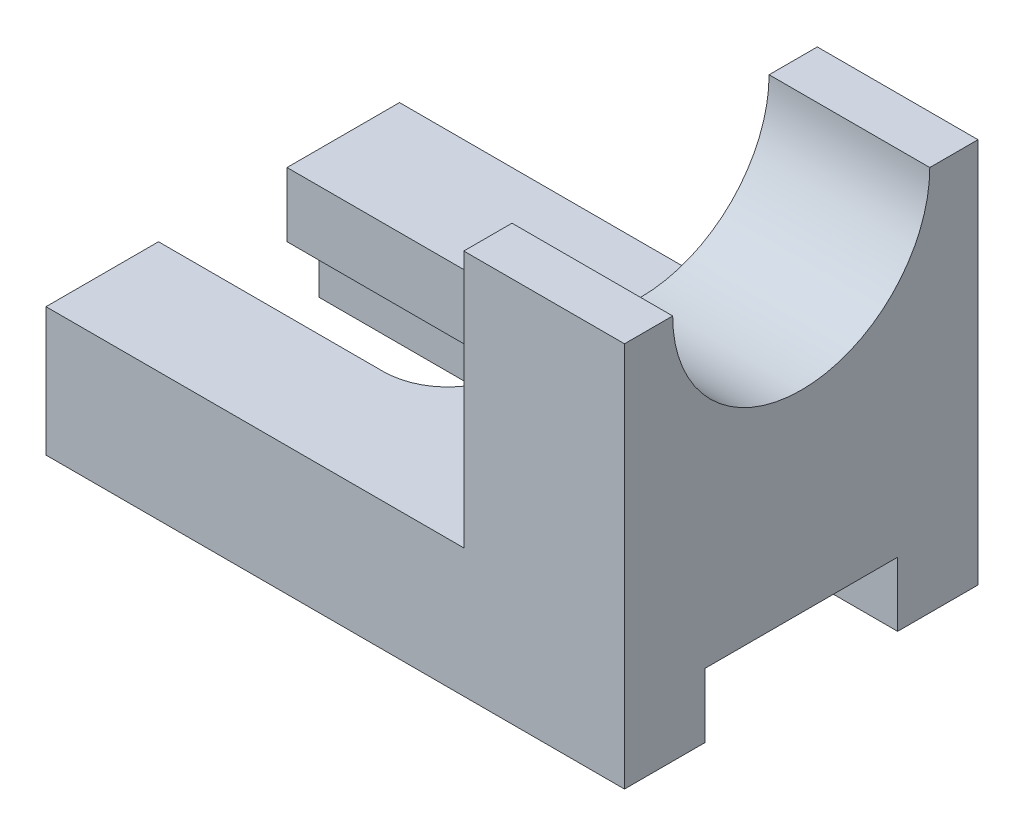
ISO-10303-21;
HEADER;
FILE_DESCRIPTION(('STEP AP214'),'2;1');
FILE_NAME('part.step','',(''),(''),'','','');
FILE_SCHEMA(('AUTOMOTIVE_DESIGN { 1 0 10303 214 1 1 1 1 }'));
ENDSEC;
DATA;
#1=APPLICATION_CONTEXT('core data for automotive mechanical design processes');
#2=APPLICATION_PROTOCOL_DEFINITION('international standard','automotive_design',2000,#1);
#3=PRODUCT_CONTEXT('',#1,'mechanical');
#4=PRODUCT('Part','Part','',(#3));
#5=PRODUCT_RELATED_PRODUCT_CATEGORY('part','',(#4));
#6=PRODUCT_DEFINITION_FORMATION('','',#4);
#7=PRODUCT_DEFINITION_CONTEXT('part definition',#1,'design');
#8=PRODUCT_DEFINITION('design','',#6,#7);
#9=PRODUCT_DEFINITION_SHAPE('','',#8);
#10=(LENGTH_UNIT() NAMED_UNIT(*) SI_UNIT(.MILLI.,.METRE.));
#11=(NAMED_UNIT(*) PLANE_ANGLE_UNIT() SI_UNIT($,.RADIAN.));
#12=(NAMED_UNIT(*) SI_UNIT($,.STERADIAN.) SOLID_ANGLE_UNIT());
#13=UNCERTAINTY_MEASURE_WITH_UNIT(LENGTH_MEASURE(1.E-05),#10,'distance_accuracy_value','');
#14=(GEOMETRIC_REPRESENTATION_CONTEXT(3) GLOBAL_UNCERTAINTY_ASSIGNED_CONTEXT((#13)) GLOBAL_UNIT_ASSIGNED_CONTEXT((#10,
#11,#12)) REPRESENTATION_CONTEXT('',''));
#15=CARTESIAN_POINT('',(0.,0.,0.));
#16=DIRECTION('',(0.,0.,1.));
#17=DIRECTION('',(1.,0.,0.));
#18=AXIS2_PLACEMENT_3D('',#15,#16,#17);
#19=CARTESIAN_POINT('',(35.,0.,-27.5));
#20=DIRECTION('',(0.,1.,0.));
#21=DIRECTION('',(0.,0.,1.));
#22=AXIS2_PLACEMENT_3D('',#19,#20,#21);
#23=PLANE('',#22);
#24=DIRECTION('',(0.,0.,1.));
#25=VECTOR('',#24,1.);
#26=CARTESIAN_POINT('',(0.,0.,0.));
#27=LINE('',#26,#25);
#28=CARTESIAN_POINT('',(0.,0.,-12.5));
#29=VERTEX_POINT('',#28);
#30=CARTESIAN_POINT('',(0.,0.,0.));
#31=VERTEX_POINT('',#30);
#32=EDGE_CURVE('E161',#29,#31,#27,.T.);
#33=ORIENTED_EDGE('',*,*,#32,.F.);
#34=DIRECTION('',(1.,0.,0.));
#35=VECTOR('',#34,1.);
#36=CARTESIAN_POINT('',(35.,0.,-12.5));
#37=LINE('',#36,#35);
#38=CARTESIAN_POINT('',(90.,0.,-12.5));
#39=VERTEX_POINT('',#38);
#40=EDGE_CURVE('E39',#29,#39,#37,.T.);
#41=ORIENTED_EDGE('',*,*,#40,.T.);
#42=DIRECTION('',(0.,0.,-1.));
#43=VECTOR('',#42,1.);
#44=CARTESIAN_POINT('',(90.,0.,0.));
#45=LINE('',#44,#43);
#46=CARTESIAN_POINT('',(90.,0.,0.));
#47=VERTEX_POINT('',#46);
#48=EDGE_CURVE('E160',#47,#39,#45,.T.);
#49=ORIENTED_EDGE('',*,*,#48,.F.);
#50=DIRECTION('',(1.,0.,0.));
#51=VECTOR('',#50,1.);
#52=CARTESIAN_POINT('',(0.,0.,0.));
#53=LINE('',#52,#51);
#54=EDGE_CURVE('E172',#31,#47,#53,.T.);
#55=ORIENTED_EDGE('',*,*,#54,.F.);
#56=EDGE_LOOP('',(#33,#41,#49,#55));
#57=FACE_BOUND('',#56,.T.);
#58=ADVANCED_FACE('F31',(#57),#23,.F.);
#59=CARTESIAN_POINT('',(65.,60.,0.));
#60=DIRECTION('',(0.,1.,0.));
#61=DIRECTION('',(0.,0.,1.));
#62=AXIS2_PLACEMENT_3D('',#59,#60,#61);
#63=PLANE('',#62);
#64=DIRECTION('',(1.,0.,0.));
#65=VECTOR('',#64,1.);
#66=CARTESIAN_POINT('',(-2.50000000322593E-05,60.,-7.49999999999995));
#67=LINE('',#66,#65);
#68=CARTESIAN_POINT('',(65.,60.,-7.49999999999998));
#69=VERTEX_POINT('',#68);
#70=CARTESIAN_POINT('',(90.,60.,-7.49999999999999));
#71=VERTEX_POINT('',#70);
#72=EDGE_CURVE('E300',#69,#71,#67,.T.);
#73=ORIENTED_EDGE('',*,*,#72,.F.);
#74=DIRECTION('',(0.,0.,1.));
#75=VECTOR('',#74,1.);
#76=CARTESIAN_POINT('',(65.,60.,-55.));
#77=LINE('',#76,#75);
#78=CARTESIAN_POINT('',(65.,60.,0.));
#79=VERTEX_POINT('',#78);
#80=EDGE_CURVE('E236',#69,#79,#77,.T.);
#81=ORIENTED_EDGE('',*,*,#80,.T.);
#82=DIRECTION('',(1.,0.,0.));
#83=VECTOR('',#82,1.);
#84=CARTESIAN_POINT('',(65.,60.,0.));
#85=LINE('',#84,#83);
#86=CARTESIAN_POINT('',(90.,60.,0.));
#87=VERTEX_POINT('',#86);
#88=EDGE_CURVE('E246',#79,#87,#85,.T.);
#89=ORIENTED_EDGE('',*,*,#88,.T.);
#90=DIRECTION('',(0.,0.,-1.));
#91=VECTOR('',#90,1.);
#92=CARTESIAN_POINT('',(90.,60.,-55.));
#93=LINE('',#92,#91);
#94=EDGE_CURVE('E242',#87,#71,#93,.T.);
#95=ORIENTED_EDGE('',*,*,#94,.T.);
#96=EDGE_LOOP('',(#73,#81,#89,#95));
#97=FACE_BOUND('',#96,.T.);
#98=ADVANCED_FACE('F336',(#97),#63,.T.);
#99=CARTESIAN_POINT('',(0.,20.,0.));
#100=DIRECTION('',(1.,0.,0.));
#101=DIRECTION('',(0.,0.,-1.));
#102=AXIS2_PLACEMENT_3D('',#99,#100,#101);
#103=PLANE('',#102);
#104=DIRECTION('',(0.,0.,1.));
#105=VECTOR('',#104,1.);
#106=CARTESIAN_POINT('',(0.,10.,0.));
#107=LINE('',#106,#105);
#108=CARTESIAN_POINT('',(0.,10.,-17.5));
#109=VERTEX_POINT('',#108);
#110=CARTESIAN_POINT('',(0.,10.,-12.5));
#111=VERTEX_POINT('',#110);
#112=EDGE_CURVE('E255',#109,#111,#107,.T.);
#113=ORIENTED_EDGE('',*,*,#112,.T.);
#114=DIRECTION('',(0.,-1.,0.));
#115=VECTOR('',#114,1.);
#116=CARTESIAN_POINT('',(0.,20.,-12.5));
#117=LINE('',#116,#115);
#118=EDGE_CURVE('E267',#111,#29,#117,.T.);
#119=ORIENTED_EDGE('',*,*,#118,.T.);
#120=ORIENTED_EDGE('',*,*,#32,.T.);
#121=DIRECTION('',(0.,-1.,0.));
#122=VECTOR('',#121,1.);
#123=CARTESIAN_POINT('',(0.,20.,0.));
#124=LINE('',#123,#122);
#125=CARTESIAN_POINT('',(0.,20.,0.));
#126=VERTEX_POINT('',#125);
#127=EDGE_CURVE('E199',#126,#31,#124,.T.);
#128=ORIENTED_EDGE('',*,*,#127,.F.);
#129=DIRECTION('',(0.,0.,1.));
#130=VECTOR('',#129,1.);
#131=CARTESIAN_POINT('',(0.,20.,0.));
#132=LINE('',#131,#130);
#133=CARTESIAN_POINT('',(0.,20.,-17.5));
#134=VERTEX_POINT('',#133);
#135=EDGE_CURVE('E178',#134,#126,#132,.T.);
#136=ORIENTED_EDGE('',*,*,#135,.F.);
#137=DIRECTION('',(0.,-1.,0.));
#138=VECTOR('',#137,1.);
#139=CARTESIAN_POINT('',(0.,20.,-17.5));
#140=LINE('',#139,#138);
#141=EDGE_CURVE('E179',#134,#109,#140,.T.);
#142=ORIENTED_EDGE('',*,*,#141,.T.);
#143=EDGE_LOOP('',(#113,#119,#120,#128,#136,#142));
#144=FACE_BOUND('',#143,.T.);
#145=ADVANCED_FACE('F33',(#144),#103,.F.);
#146=CARTESIAN_POINT('',(0.,20.,0.));
#147=DIRECTION('',(0.,0.,-1.));
#148=DIRECTION('',(-1.,0.,0.));
#149=AXIS2_PLACEMENT_3D('',#146,#147,#148);
#150=PLANE('',#149);
#151=ORIENTED_EDGE('',*,*,#54,.T.);
#152=DIRECTION('',(0.,-1.,0.));
#153=VECTOR('',#152,1.);
#154=CARTESIAN_POINT('',(90.,20.,0.));
#155=LINE('',#154,#153);
#156=EDGE_CURVE('E166',#87,#47,#155,.T.);
#157=ORIENTED_EDGE('',*,*,#156,.F.);
#158=ORIENTED_EDGE('',*,*,#88,.F.);
#159=DIRECTION('',(0.,-1.,0.));
#160=VECTOR('',#159,1.);
#161=CARTESIAN_POINT('',(65.,60.,0.));
#162=LINE('',#161,#160);
#163=CARTESIAN_POINT('',(65.,20.,0.));
#164=VERTEX_POINT('',#163);
#165=EDGE_CURVE('E220',#79,#164,#162,.T.);
#166=ORIENTED_EDGE('',*,*,#165,.T.);
#167=DIRECTION('',(1.,0.,0.));
#168=VECTOR('',#167,1.);
#169=CARTESIAN_POINT('',(0.,20.,0.));
#170=LINE('',#169,#168);
#171=EDGE_CURVE('E203',#126,#164,#170,.T.);
#172=ORIENTED_EDGE('',*,*,#171,.F.);
#173=ORIENTED_EDGE('',*,*,#127,.T.);
#174=EDGE_LOOP('',(#151,#157,#158,#166,#172,#173));
#175=FACE_BOUND('',#174,.T.);
#176=ADVANCED_FACE('F320',(#175),#150,.F.);
#177=CARTESIAN_POINT('',(90.,20.,0.));
#178=DIRECTION('',(-1.,0.,0.));
#179=DIRECTION('',(0.,0.,1.));
#180=AXIS2_PLACEMENT_3D('',#177,#178,#179);
#181=PLANE('',#180);
#182=ORIENTED_EDGE('',*,*,#48,.T.);
#183=DIRECTION('',(0.,-1.,0.));
#184=VECTOR('',#183,1.);
#185=CARTESIAN_POINT('',(90.,0.,-12.5));
#186=LINE('',#185,#184);
#187=CARTESIAN_POINT('',(90.,10.,-12.5));
#188=VERTEX_POINT('',#187);
#189=EDGE_CURVE('E144',#188,#39,#186,.T.);
#190=ORIENTED_EDGE('',*,*,#189,.F.);
#191=DIRECTION('',(0.,0.,1.));
#192=VECTOR('',#191,1.);
#193=CARTESIAN_POINT('',(90.,10.,-12.5));
#194=LINE('',#193,#192);
#195=CARTESIAN_POINT('',(90.,10.,-42.5));
#196=VERTEX_POINT('',#195);
#197=EDGE_CURVE('E272',#196,#188,#194,.T.);
#198=ORIENTED_EDGE('',*,*,#197,.F.);
#199=DIRECTION('',(0.,1.,0.));
#200=VECTOR('',#199,1.);
#201=CARTESIAN_POINT('',(90.,0.,-42.5));
#202=LINE('',#201,#200);
#203=CARTESIAN_POINT('',(90.,0.,-42.5));
#204=VERTEX_POINT('',#203);
#205=EDGE_CURVE('E154',#204,#196,#202,.T.);
#206=ORIENTED_EDGE('',*,*,#205,.F.);
#207=CARTESIAN_POINT('',(90.,0.,-55.));
#208=VERTEX_POINT('',#207);
#209=EDGE_CURVE('E168',#204,#208,#45,.T.);
#210=ORIENTED_EDGE('',*,*,#209,.T.);
#211=DIRECTION('',(0.,-1.,0.));
#212=VECTOR('',#211,1.);
#213=CARTESIAN_POINT('',(90.,20.,-55.));
#214=LINE('',#213,#212);
#215=CARTESIAN_POINT('',(90.,60.,-55.));
#216=VERTEX_POINT('',#215);
#217=EDGE_CURVE('E195',#216,#208,#214,.T.);
#218=ORIENTED_EDGE('',*,*,#217,.F.);
#219=CARTESIAN_POINT('',(90.,60.,-47.5));
#220=VERTEX_POINT('',#219);
#221=EDGE_CURVE('E245',#220,#216,#93,.T.);
#222=ORIENTED_EDGE('',*,*,#221,.F.);
#223=CARTESIAN_POINT('',(90.,60.,-27.5));
#224=DIRECTION('',(1.,0.,0.));
#225=DIRECTION('',(0.,0.,-1.));
#226=AXIS2_PLACEMENT_3D('',#223,#224,#225);
#227=CIRCLE('',#226,20.);
#228=EDGE_CURVE('E54',#71,#220,#227,.T.);
#229=ORIENTED_EDGE('',*,*,#228,.F.);
#230=ORIENTED_EDGE('',*,*,#94,.F.);
#231=ORIENTED_EDGE('',*,*,#156,.T.);
#232=EDGE_LOOP('',(#182,#190,#198,#206,#210,#218,#222,#229,#230,#231));
#233=FACE_BOUND('',#232,.T.);
#234=ADVANCED_FACE('F164',(#233),#181,.F.);
#235=CARTESIAN_POINT('',(0.,20.,-55.));
#236=DIRECTION('',(0.,0.,1.));
#237=DIRECTION('',(1.,0.,0.));
#238=AXIS2_PLACEMENT_3D('',#235,#236,#237);
#239=PLANE('',#238);
#240=DIRECTION('',(-1.,0.,0.));
#241=VECTOR('',#240,1.);
#242=CARTESIAN_POINT('',(0.,0.,-55.));
#243=LINE('',#242,#241);
#244=CARTESIAN_POINT('',(0.,0.,-55.));
#245=VERTEX_POINT('',#244);
#246=EDGE_CURVE('E167',#208,#245,#243,.T.);
#247=ORIENTED_EDGE('',*,*,#246,.T.);
#248=DIRECTION('',(0.,-1.,0.));
#249=VECTOR('',#248,1.);
#250=CARTESIAN_POINT('',(0.,20.,-55.));
#251=LINE('',#250,#249);
#252=CARTESIAN_POINT('',(0.,20.,-55.));
#253=VERTEX_POINT('',#252);
#254=EDGE_CURVE('E192',#253,#245,#251,.T.);
#255=ORIENTED_EDGE('',*,*,#254,.F.);
#256=DIRECTION('',(-1.,0.,0.));
#257=VECTOR('',#256,1.);
#258=CARTESIAN_POINT('',(0.,20.,-55.));
#259=LINE('',#258,#257);
#260=CARTESIAN_POINT('',(64.9999999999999,20.,-55.));
#261=VERTEX_POINT('',#260);
#262=EDGE_CURVE('E206',#261,#253,#259,.T.);
#263=ORIENTED_EDGE('',*,*,#262,.F.);
#264=DIRECTION('',(0.,-1.,0.));
#265=VECTOR('',#264,1.);
#266=CARTESIAN_POINT('',(65.,60.,-55.));
#267=LINE('',#266,#265);
#268=CARTESIAN_POINT('',(65.,60.,-55.));
#269=VERTEX_POINT('',#268);
#270=EDGE_CURVE('E224',#269,#261,#267,.T.);
#271=ORIENTED_EDGE('',*,*,#270,.F.);
#272=DIRECTION('',(-1.,0.,0.));
#273=VECTOR('',#272,1.);
#274=CARTESIAN_POINT('',(65.,60.,-55.));
#275=LINE('',#274,#273);
#276=EDGE_CURVE('E230',#216,#269,#275,.T.);
#277=ORIENTED_EDGE('',*,*,#276,.F.);
#278=ORIENTED_EDGE('',*,*,#217,.T.);
#279=EDGE_LOOP('',(#247,#255,#263,#271,#277,#278));
#280=FACE_BOUND('',#279,.T.);
#281=ADVANCED_FACE('F317',(#280),#239,.F.);
#282=CARTESIAN_POINT('',(0.,20.,-37.5));
#283=DIRECTION('',(1.,0.,0.));
#284=DIRECTION('',(0.,0.,-1.));
#285=AXIS2_PLACEMENT_3D('',#282,#283,#284);
#286=PLANE('',#285);
#287=DIRECTION('',(0.,1.,0.));
#288=VECTOR('',#287,1.);
#289=CARTESIAN_POINT('',(0.,20.,-42.5));
#290=LINE('',#289,#288);
#291=CARTESIAN_POINT('',(0.,0.,-42.5));
#292=VERTEX_POINT('',#291);
#293=CARTESIAN_POINT('',(0.,10.,-42.5));
#294=VERTEX_POINT('',#293);
#295=EDGE_CURVE('E46',#292,#294,#290,.T.);
#296=ORIENTED_EDGE('',*,*,#295,.T.);
#297=DIRECTION('',(0.,0.,1.));
#298=VECTOR('',#297,1.);
#299=CARTESIAN_POINT('',(0.,10.,-37.5));
#300=LINE('',#299,#298);
#301=CARTESIAN_POINT('',(0.,10.,-37.5));
#302=VERTEX_POINT('',#301);
#303=EDGE_CURVE('E258',#294,#302,#300,.T.);
#304=ORIENTED_EDGE('',*,*,#303,.T.);
#305=DIRECTION('',(0.,-1.,0.));
#306=VECTOR('',#305,1.);
#307=CARTESIAN_POINT('',(0.,20.,-37.5));
#308=LINE('',#307,#306);
#309=CARTESIAN_POINT('',(0.,20.,-37.5));
#310=VERTEX_POINT('',#309);
#311=EDGE_CURVE('E189',#310,#302,#308,.T.);
#312=ORIENTED_EDGE('',*,*,#311,.F.);
#313=DIRECTION('',(0.,0.,1.));
#314=VECTOR('',#313,1.);
#315=CARTESIAN_POINT('',(0.,20.,-37.5));
#316=LINE('',#315,#314);
#317=EDGE_CURVE('E214',#253,#310,#316,.T.);
#318=ORIENTED_EDGE('',*,*,#317,.F.);
#319=ORIENTED_EDGE('',*,*,#254,.T.);
#320=DIRECTION('',(0.,0.,1.));
#321=VECTOR('',#320,1.);
#322=CARTESIAN_POINT('',(0.,0.,-37.5));
#323=LINE('',#322,#321);
#324=EDGE_CURVE('E170',#245,#292,#323,.T.);
#325=ORIENTED_EDGE('',*,*,#324,.T.);
#326=EDGE_LOOP('',(#296,#304,#312,#318,#319,#325));
#327=FACE_BOUND('',#326,.T.);
#328=ADVANCED_FACE('F283',(#327),#286,.F.);
#329=CARTESIAN_POINT('',(0.,20.,-37.5));
#330=DIRECTION('',(0.,0.,-1.));
#331=DIRECTION('',(-1.,0.,0.));
#332=AXIS2_PLACEMENT_3D('',#329,#330,#331);
#333=PLANE('',#332);
#334=ORIENTED_EDGE('',*,*,#311,.T.);
#335=DIRECTION('',(1.,0.,0.));
#336=VECTOR('',#335,1.);
#337=CARTESIAN_POINT('',(0.,10.,-37.5));
#338=LINE('',#337,#336);
#339=CARTESIAN_POINT('',(35.,10.,-37.5));
#340=VERTEX_POINT('',#339);
#341=EDGE_CURVE('E261',#302,#340,#338,.T.);
#342=ORIENTED_EDGE('',*,*,#341,.T.);
#343=DIRECTION('',(0.,-1.,0.));
#344=VECTOR('',#343,1.);
#345=CARTESIAN_POINT('',(35.,20.,-37.5));
#346=LINE('',#345,#344);
#347=CARTESIAN_POINT('',(35.,20.,-37.5));
#348=VERTEX_POINT('',#347);
#349=EDGE_CURVE('E186',#348,#340,#346,.T.);
#350=ORIENTED_EDGE('',*,*,#349,.F.);
#351=DIRECTION('',(1.,0.,0.));
#352=VECTOR('',#351,1.);
#353=CARTESIAN_POINT('',(0.,20.,-37.5));
#354=LINE('',#353,#352);
#355=EDGE_CURVE('E216',#310,#348,#354,.T.);
#356=ORIENTED_EDGE('',*,*,#355,.F.);
#357=EDGE_LOOP('',(#334,#342,#350,#356));
#358=FACE_BOUND('',#357,.T.);
#359=ADVANCED_FACE('F287',(#358),#333,.F.);
#360=CARTESIAN_POINT('',(35.,20.,-27.5));
#361=DIRECTION('',(0.,-1.,0.));
#362=DIRECTION('',(0.,0.,-1.));
#363=AXIS2_PLACEMENT_3D('',#360,#361,#362);
#364=CYLINDRICAL_SURFACE('',#363,10.);
#365=ORIENTED_EDGE('',*,*,#349,.T.);
#366=CARTESIAN_POINT('',(35.,10.,-27.5));
#367=DIRECTION('',(0.,1.,0.));
#368=DIRECTION('',(0.,0.,1.));
#369=AXIS2_PLACEMENT_3D('',#366,#367,#368);
#370=CIRCLE('',#369,10.);
#371=CARTESIAN_POINT('',(35.,10.,-17.5));
#372=VERTEX_POINT('',#371);
#373=EDGE_CURVE('E264',#340,#372,#370,.F.);
#374=ORIENTED_EDGE('',*,*,#373,.T.);
#375=DIRECTION('',(0.,-1.,0.));
#376=VECTOR('',#375,1.);
#377=CARTESIAN_POINT('',(35.,20.,-17.5));
#378=LINE('',#377,#376);
#379=CARTESIAN_POINT('',(35.,20.,-17.5));
#380=VERTEX_POINT('',#379);
#381=EDGE_CURVE('E182',#380,#372,#378,.T.);
#382=ORIENTED_EDGE('',*,*,#381,.F.);
#383=CARTESIAN_POINT('',(35.,20.,-27.5));
#384=DIRECTION('',(0.,-1.,0.));
#385=DIRECTION('',(0.,0.,1.));
#386=AXIS2_PLACEMENT_3D('',#383,#384,#385);
#387=CIRCLE('',#386,10.);
#388=EDGE_CURVE('E218',#348,#380,#387,.T.);
#389=ORIENTED_EDGE('',*,*,#388,.F.);
#390=EDGE_LOOP('',(#365,#374,#382,#389));
#391=FACE_BOUND('',#390,.T.);
#392=ADVANCED_FACE('F326',(#391),#364,.F.);
#393=CARTESIAN_POINT('',(0.,20.,-17.5));
#394=DIRECTION('',(0.,0.,1.));
#395=DIRECTION('',(1.,0.,0.));
#396=AXIS2_PLACEMENT_3D('',#393,#394,#395);
#397=PLANE('',#396);
#398=ORIENTED_EDGE('',*,*,#381,.T.);
#399=DIRECTION('',(-1.,0.,0.));
#400=VECTOR('',#399,1.);
#401=CARTESIAN_POINT('',(0.,10.,-17.5));
#402=LINE('',#401,#400);
#403=EDGE_CURVE('E11',#372,#109,#402,.T.);
#404=ORIENTED_EDGE('',*,*,#403,.T.);
#405=ORIENTED_EDGE('',*,*,#141,.F.);
#406=DIRECTION('',(-1.,0.,0.));
#407=VECTOR('',#406,1.);
#408=CARTESIAN_POINT('',(0.,20.,-17.5));
#409=LINE('',#408,#407);
#410=EDGE_CURVE('E183',#380,#134,#409,.T.);
#411=ORIENTED_EDGE('',*,*,#410,.F.);
#412=EDGE_LOOP('',(#398,#404,#405,#411));
#413=FACE_BOUND('',#412,.T.);
#414=ADVANCED_FACE('F324',(#413),#397,.F.);
#415=CARTESIAN_POINT('',(35.,20.,-27.5));
#416=DIRECTION('',(0.,1.,0.));
#417=DIRECTION('',(0.,0.,1.));
#418=AXIS2_PLACEMENT_3D('',#415,#416,#417);
#419=PLANE('',#418);
#420=DIRECTION('',(0.,0.,1.));
#421=VECTOR('',#420,1.);
#422=CARTESIAN_POINT('',(65.,20.,-55.));
#423=LINE('',#422,#421);
#424=EDGE_CURVE('E235',#261,#164,#423,.T.);
#425=ORIENTED_EDGE('',*,*,#424,.F.);
#426=ORIENTED_EDGE('',*,*,#262,.T.);
#427=ORIENTED_EDGE('',*,*,#317,.T.);
#428=ORIENTED_EDGE('',*,*,#355,.T.);
#429=ORIENTED_EDGE('',*,*,#388,.T.);
#430=ORIENTED_EDGE('',*,*,#410,.T.);
#431=ORIENTED_EDGE('',*,*,#135,.T.);
#432=ORIENTED_EDGE('',*,*,#171,.T.);
#433=EDGE_LOOP('',(#425,#426,#427,#428,#429,#430,#431,#432));
#434=FACE_BOUND('',#433,.T.);
#435=ADVANCED_FACE('F291',(#434),#419,.T.);
#436=ORIENTED_EDGE('',*,*,#209,.F.);
#437=DIRECTION('',(-1.,0.,0.));
#438=VECTOR('',#437,1.);
#439=CARTESIAN_POINT('',(35.,0.,-42.5));
#440=LINE('',#439,#438);
#441=EDGE_CURVE('E162',#204,#292,#440,.T.);
#442=ORIENTED_EDGE('',*,*,#441,.T.);
#443=ORIENTED_EDGE('',*,*,#324,.F.);
#444=ORIENTED_EDGE('',*,*,#246,.F.);
#445=EDGE_LOOP('',(#436,#442,#443,#444));
#446=FACE_BOUND('',#445,.T.);
#447=ADVANCED_FACE('F299',(#446),#23,.F.);
#448=CARTESIAN_POINT('',(65.,60.,-55.));
#449=DIRECTION('',(1.,0.,0.));
#450=DIRECTION('',(0.,0.,-1.));
#451=AXIS2_PLACEMENT_3D('',#448,#449,#450);
#452=PLANE('',#451);
#453=ORIENTED_EDGE('',*,*,#80,.F.);
#454=CARTESIAN_POINT('',(65.,60.,-27.5));
#455=DIRECTION('',(1.,0.,0.));
#456=DIRECTION('',(0.,0.,-1.));
#457=AXIS2_PLACEMENT_3D('',#454,#455,#456);
#458=CIRCLE('',#457,20.);
#459=CARTESIAN_POINT('',(65.,60.,-47.5));
#460=VERTEX_POINT('',#459);
#461=EDGE_CURVE('E237',#69,#460,#458,.T.);
#462=ORIENTED_EDGE('',*,*,#461,.T.);
#463=EDGE_CURVE('E249',#269,#460,#77,.T.);
#464=ORIENTED_EDGE('',*,*,#463,.F.);
#465=ORIENTED_EDGE('',*,*,#270,.T.);
#466=ORIENTED_EDGE('',*,*,#424,.T.);
#467=ORIENTED_EDGE('',*,*,#165,.F.);
#468=EDGE_LOOP('',(#453,#462,#464,#465,#466,#467));
#469=FACE_BOUND('',#468,.T.);
#470=ADVANCED_FACE('F312',(#469),#452,.F.);
#471=DIRECTION('',(1.,0.,0.));
#472=VECTOR('',#471,1.);
#473=CARTESIAN_POINT('',(-2.50000000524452E-05,60.,-47.5));
#474=LINE('',#473,#472);
#475=EDGE_CURVE('E202',#220,#460,#474,.F.);
#476=ORIENTED_EDGE('',*,*,#475,.F.);
#477=ORIENTED_EDGE('',*,*,#221,.T.);
#478=ORIENTED_EDGE('',*,*,#276,.T.);
#479=ORIENTED_EDGE('',*,*,#463,.T.);
#480=EDGE_LOOP('',(#476,#477,#478,#479));
#481=FACE_BOUND('',#480,.T.);
#482=ADVANCED_FACE('F313',(#481),#63,.T.);
#483=CARTESIAN_POINT('',(-2.50000000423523E-05,60.,-27.5));
#484=DIRECTION('',(1.,0.,0.));
#485=DIRECTION('',(0.,0.,-1.));
#486=AXIS2_PLACEMENT_3D('',#483,#484,#485);
#487=CYLINDRICAL_SURFACE('',#486,20.);
#488=ORIENTED_EDGE('',*,*,#72,.T.);
#489=ORIENTED_EDGE('',*,*,#228,.T.);
#490=ORIENTED_EDGE('',*,*,#475,.T.);
#491=ORIENTED_EDGE('',*,*,#461,.F.);
#492=EDGE_LOOP('',(#488,#489,#490,#491));
#493=FACE_BOUND('',#492,.T.);
#494=ADVANCED_FACE('F305',(#493),#487,.F.);
#495=CARTESIAN_POINT('',(-2.50000000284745E-05,10.,-12.5));
#496=DIRECTION('',(0.,1.,0.));
#497=DIRECTION('',(0.,0.,1.));
#498=AXIS2_PLACEMENT_3D('',#495,#496,#497);
#499=PLANE('',#498);
#500=ORIENTED_EDGE('',*,*,#403,.F.);
#501=ORIENTED_EDGE('',*,*,#373,.F.);
#502=ORIENTED_EDGE('',*,*,#341,.F.);
#503=ORIENTED_EDGE('',*,*,#303,.F.);
#504=DIRECTION('',(1.,0.,0.));
#505=VECTOR('',#504,1.);
#506=CARTESIAN_POINT('',(-2.500000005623E-05,10.,-42.5));
#507=LINE('',#506,#505);
#508=EDGE_CURVE('E270',#294,#196,#507,.T.);
#509=ORIENTED_EDGE('',*,*,#508,.T.);
#510=ORIENTED_EDGE('',*,*,#197,.T.);
#511=DIRECTION('',(1.,0.,0.));
#512=VECTOR('',#511,1.);
#513=CARTESIAN_POINT('',(-2.50000000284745E-05,10.,-12.5));
#514=LINE('',#513,#512);
#515=EDGE_CURVE('E149',#111,#188,#514,.T.);
#516=ORIENTED_EDGE('',*,*,#515,.F.);
#517=ORIENTED_EDGE('',*,*,#112,.F.);
#518=EDGE_LOOP('',(#500,#501,#502,#503,#509,#510,#516,#517));
#519=FACE_BOUND('',#518,.T.);
#520=ADVANCED_FACE('F280',(#519),#499,.F.);
#521=CARTESIAN_POINT('',(-2.50000000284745E-05,0.,-12.5));
#522=DIRECTION('',(0.,0.,1.));
#523=DIRECTION('',(1.,0.,0.));
#524=AXIS2_PLACEMENT_3D('',#521,#522,#523);
#525=PLANE('',#524);
#526=ORIENTED_EDGE('',*,*,#515,.T.);
#527=ORIENTED_EDGE('',*,*,#189,.T.);
#528=ORIENTED_EDGE('',*,*,#40,.F.);
#529=ORIENTED_EDGE('',*,*,#118,.F.);
#530=EDGE_LOOP('',(#526,#527,#528,#529));
#531=FACE_BOUND('',#530,.T.);
#532=ADVANCED_FACE('F146',(#531),#525,.F.);
#533=CARTESIAN_POINT('',(-2.500000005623E-05,0.,-42.5));
#534=DIRECTION('',(0.,0.,-1.));
#535=DIRECTION('',(-1.,0.,0.));
#536=AXIS2_PLACEMENT_3D('',#533,#534,#535);
#537=PLANE('',#536);
#538=ORIENTED_EDGE('',*,*,#441,.F.);
#539=ORIENTED_EDGE('',*,*,#205,.T.);
#540=ORIENTED_EDGE('',*,*,#508,.F.);
#541=ORIENTED_EDGE('',*,*,#295,.F.);
#542=EDGE_LOOP('',(#538,#539,#540,#541));
#543=FACE_BOUND('',#542,.T.);
#544=ADVANCED_FACE('F277',(#543),#537,.F.);
#545=CLOSED_SHELL('',(#58,#98,#145,#176,#234,#281,#328,#359,#392,#414,#435,#447,#470,#482,#494,
#520,#532,#544));
#546=MANIFOLD_SOLID_BREP('B2',#545);
#547=ADVANCED_BREP_SHAPE_REPRESENTATION('',(#18,#546),#14);
#548=SHAPE_DEFINITION_REPRESENTATION(#9,#547);
ENDSEC;
END-ISO-10303-21;
